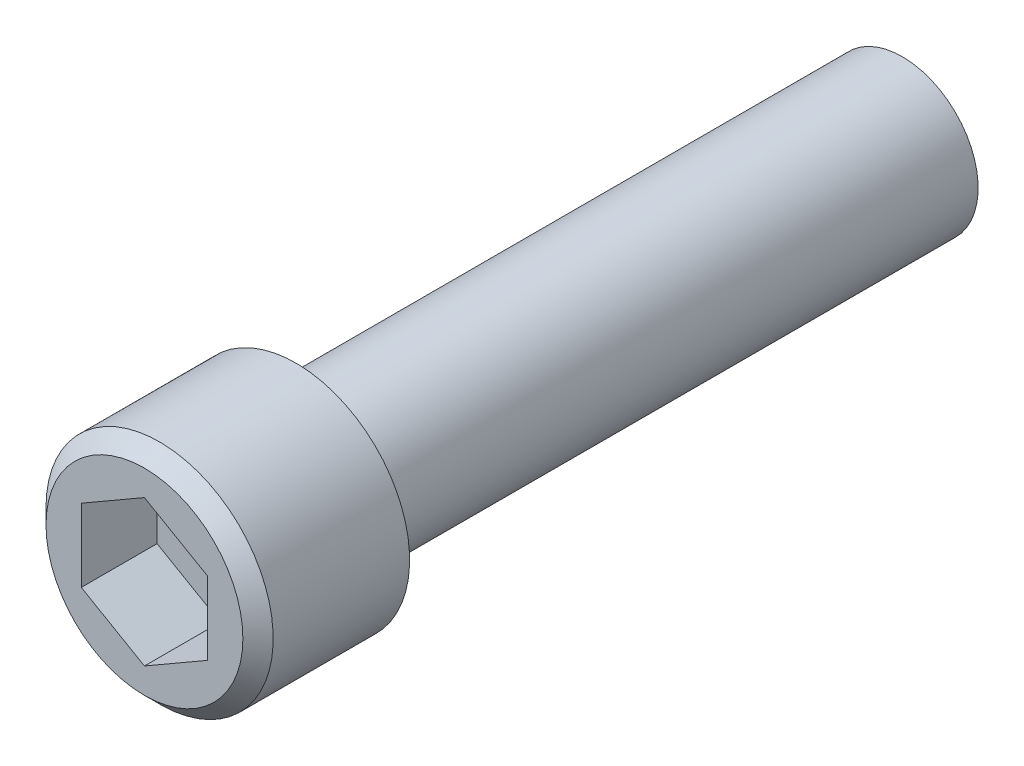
ISO-10303-21;
HEADER;
FILE_DESCRIPTION(('STEP AP214'),'2;1');
FILE_NAME('part.step','',(''),(''),'','','');
FILE_SCHEMA(('AUTOMOTIVE_DESIGN { 1 0 10303 214 1 1 1 1 }'));
ENDSEC;
DATA;
#1=APPLICATION_CONTEXT('core data for automotive mechanical design processes');
#2=APPLICATION_PROTOCOL_DEFINITION('international standard','automotive_design',2000,#1);
#3=PRODUCT_CONTEXT('',#1,'mechanical');
#4=PRODUCT('Part','Part','',(#3));
#5=PRODUCT_RELATED_PRODUCT_CATEGORY('part','',(#4));
#6=PRODUCT_DEFINITION_FORMATION('','',#4);
#7=PRODUCT_DEFINITION_CONTEXT('part definition',#1,'design');
#8=PRODUCT_DEFINITION('design','',#6,#7);
#9=PRODUCT_DEFINITION_SHAPE('','',#8);
#10=(LENGTH_UNIT() NAMED_UNIT(*) SI_UNIT(.MILLI.,.METRE.));
#11=(NAMED_UNIT(*) PLANE_ANGLE_UNIT() SI_UNIT($,.RADIAN.));
#12=(NAMED_UNIT(*) SI_UNIT($,.STERADIAN.) SOLID_ANGLE_UNIT());
#13=UNCERTAINTY_MEASURE_WITH_UNIT(LENGTH_MEASURE(1.E-05),#10,'distance_accuracy_value','');
#14=(GEOMETRIC_REPRESENTATION_CONTEXT(3) GLOBAL_UNCERTAINTY_ASSIGNED_CONTEXT((#13)) GLOBAL_UNIT_ASSIGNED_CONTEXT((#10,
#11,#12)) REPRESENTATION_CONTEXT('',''));
#15=CARTESIAN_POINT('',(0.,0.,0.));
#16=DIRECTION('',(0.,0.,1.));
#17=DIRECTION('',(1.,0.,0.));
#18=AXIS2_PLACEMENT_3D('',#15,#16,#17);
#19=CARTESIAN_POINT('',(-1.11022302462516E-13,-1.11022302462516E-13,38.0999999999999));
#20=DIRECTION('',(0.,0.,-0.999999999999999));
#21=DIRECTION('',(-1.,0.,0.));
#22=AXIS2_PLACEMENT_3D('',#19,#20,#21);
#23=CYLINDRICAL_SURFACE('',#22,4.7625);
#24=CARTESIAN_POINT('',(1.11022302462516E-13,2.22044604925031E-13,37.5920000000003));
#25=DIRECTION('',(0.,0.,1.));
#26=DIRECTION('',(1.,0.,0.));
#27=AXIS2_PLACEMENT_3D('',#24,#25,#26);
#28=CIRCLE('',#27,4.7625);
#29=CARTESIAN_POINT('',(-4.76250000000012,-1.10273484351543E-13,37.5920000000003));
#30=VERTEX_POINT('',#29);
#31=EDGE_CURVE('E151',#30,#30,#28,.F.);
#32=CARTESIAN_POINT('',(0.,0.,0.));
#33=DIRECTION('',(0.,0.,1.));
#34=DIRECTION('',(1.,0.,0.));
#35=AXIS2_PLACEMENT_3D('',#32,#33,#34);
#36=CIRCLE('',#35,4.7625);
#37=CARTESIAN_POINT('',(-4.76250000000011,-1.13551496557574E-13,0.));
#38=VERTEX_POINT('',#37);
#39=EDGE_CURVE('E145',#38,#38,#36,.T.);
#40=CARTESIAN_POINT('',(-4.76250000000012,-1.10273484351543E-13,37.5920000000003));
#41=CARTESIAN_POINT('',(-4.76250000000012,-1.10307630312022E-13,37.200416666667));
#42=CARTESIAN_POINT('',(-4.76250000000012,-1.10341776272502E-13,36.8088333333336));
#43=CARTESIAN_POINT('',(-4.76250000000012,-1.10410068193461E-13,36.0256666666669));
#44=CARTESIAN_POINT('',(-4.76250000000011,-1.1044421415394E-13,35.6340833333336));
#45=CARTESIAN_POINT('',(-4.76250000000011,-1.10512506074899E-13,34.8509166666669));
#46=CARTESIAN_POINT('',(-4.76250000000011,-1.10546652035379E-13,34.4593333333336));
#47=CARTESIAN_POINT('',(-4.76250000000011,-1.10614943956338E-13,33.6761666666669));
#48=CARTESIAN_POINT('',(-4.76250000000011,-1.10649089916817E-13,33.2845833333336));
#49=CARTESIAN_POINT('',(-4.76250000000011,-1.10717381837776E-13,32.5014166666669));
#50=CARTESIAN_POINT('',(-4.76250000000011,-1.10751527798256E-13,32.1098333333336));
#51=CARTESIAN_POINT('',(-4.76250000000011,-1.10819819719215E-13,31.3266666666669));
#52=CARTESIAN_POINT('',(-4.76250000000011,-1.10853965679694E-13,30.9350833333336));
#53=CARTESIAN_POINT('',(-4.76250000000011,-1.10922257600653E-13,30.1519166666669));
#54=CARTESIAN_POINT('',(-4.76250000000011,-1.10956403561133E-13,29.7603333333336));
#55=CARTESIAN_POINT('',(-4.76250000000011,-1.11024695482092E-13,28.9771666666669));
#56=CARTESIAN_POINT('',(-4.76250000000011,-1.11058841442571E-13,28.5855833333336));
#57=CARTESIAN_POINT('',(-4.76250000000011,-1.1112713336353E-13,27.8024166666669));
#58=CARTESIAN_POINT('',(-4.76250000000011,-1.1116127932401E-13,27.4108333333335));
#59=CARTESIAN_POINT('',(-4.76250000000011,-1.11229571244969E-13,26.6276666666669));
#60=CARTESIAN_POINT('',(-4.76250000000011,-1.11263717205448E-13,26.2360833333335));
#61=CARTESIAN_POINT('',(-4.76250000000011,-1.11332009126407E-13,25.4529166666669));
#62=CARTESIAN_POINT('',(-4.76250000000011,-1.11366155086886E-13,25.0613333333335));
#63=CARTESIAN_POINT('',(-4.76250000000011,-1.11434447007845E-13,24.2781666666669));
#64=CARTESIAN_POINT('',(-4.76250000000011,-1.11468592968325E-13,23.8865833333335));
#65=CARTESIAN_POINT('',(-4.76250000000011,-1.11536884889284E-13,23.1034166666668));
#66=CARTESIAN_POINT('',(-4.76250000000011,-1.11571030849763E-13,22.7118333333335));
#67=CARTESIAN_POINT('',(-4.76250000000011,-1.11639322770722E-13,21.9286666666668));
#68=CARTESIAN_POINT('',(-4.76250000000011,-1.11673468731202E-13,21.5370833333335));
#69=CARTESIAN_POINT('',(-4.76250000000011,-1.11741760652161E-13,20.7539166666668));
#70=CARTESIAN_POINT('',(-4.76250000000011,-1.1177590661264E-13,20.3623333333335));
#71=CARTESIAN_POINT('',(-4.76250000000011,-1.11844198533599E-13,19.5791666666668));
#72=CARTESIAN_POINT('',(-4.76250000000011,-1.11878344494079E-13,19.1875833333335));
#73=CARTESIAN_POINT('',(-4.76250000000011,-1.11946636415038E-13,18.4044166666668));
#74=CARTESIAN_POINT('',(-4.76250000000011,-1.11980782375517E-13,18.0128333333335));
#75=CARTESIAN_POINT('',(-4.76250000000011,-1.12049074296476E-13,17.2296666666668));
#76=CARTESIAN_POINT('',(-4.76250000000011,-1.12083220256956E-13,16.8380833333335));
#77=CARTESIAN_POINT('',(-4.76250000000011,-1.12151512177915E-13,16.0549166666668));
#78=CARTESIAN_POINT('',(-4.76250000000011,-1.12185658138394E-13,15.6633333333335));
#79=CARTESIAN_POINT('',(-4.76250000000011,-1.12253950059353E-13,14.8801666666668));
#80=CARTESIAN_POINT('',(-4.76250000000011,-1.12288096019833E-13,14.4885833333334));
#81=CARTESIAN_POINT('',(-4.76250000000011,-1.12356387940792E-13,13.7054166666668));
#82=CARTESIAN_POINT('',(-4.76250000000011,-1.12390533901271E-13,13.3138333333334));
#83=CARTESIAN_POINT('',(-4.76250000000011,-1.1245882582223E-13,12.5306666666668));
#84=CARTESIAN_POINT('',(-4.76250000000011,-1.1249297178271E-13,12.1390833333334));
#85=CARTESIAN_POINT('',(-4.76250000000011,-1.12561263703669E-13,11.3559166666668));
#86=CARTESIAN_POINT('',(-4.76250000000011,-1.12595409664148E-13,10.9643333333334));
#87=CARTESIAN_POINT('',(-4.76250000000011,-1.12663701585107E-13,10.1811666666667));
#88=CARTESIAN_POINT('',(-4.76250000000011,-1.12697847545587E-13,9.78958333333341));
#89=CARTESIAN_POINT('',(-4.76250000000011,-1.12766139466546E-13,9.00641666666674));
#90=CARTESIAN_POINT('',(-4.76250000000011,-1.12800285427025E-13,8.6148333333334));
#91=CARTESIAN_POINT('',(-4.76250000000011,-1.12868577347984E-13,7.83166666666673));
#92=CARTESIAN_POINT('',(-4.76250000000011,-1.12902723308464E-13,7.44008333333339));
#93=CARTESIAN_POINT('',(-4.76250000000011,-1.12971015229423E-13,6.65691666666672));
#94=CARTESIAN_POINT('',(-4.76250000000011,-1.13005161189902E-13,6.26533333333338));
#95=CARTESIAN_POINT('',(-4.76250000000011,-1.13073453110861E-13,5.4821666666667));
#96=CARTESIAN_POINT('',(-4.76250000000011,-1.13107599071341E-13,5.09058333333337));
#97=CARTESIAN_POINT('',(-4.76250000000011,-1.131758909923E-13,4.30741666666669));
#98=CARTESIAN_POINT('',(-4.76250000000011,-1.13210036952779E-13,3.91583333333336));
#99=CARTESIAN_POINT('',(-4.76250000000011,-1.13278328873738E-13,3.13266666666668));
#100=CARTESIAN_POINT('',(-4.76250000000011,-1.13312474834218E-13,2.74108333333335));
#101=CARTESIAN_POINT('',(-4.76250000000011,-1.13380766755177E-13,1.95791666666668));
#102=CARTESIAN_POINT('',(-4.76250000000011,-1.13414912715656E-13,1.56633333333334));
#103=CARTESIAN_POINT('',(-4.76250000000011,-1.13483204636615E-13,0.783166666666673));
#104=CARTESIAN_POINT('',(-4.76250000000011,-1.13517350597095E-13,0.391583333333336));
#105=CARTESIAN_POINT('',(-4.76250000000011,-1.13551496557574E-13,0.));
#106=B_SPLINE_CURVE_WITH_KNOTS('',3,(#40,#41,#42,#43,#44,#45,#46,#47,#48,#49,#50,#51,#52,#53,
#54,#55,#56,#57,#58,#59,#60,#61,#62,#63,#64,#65,#66,#67,#68,#69,#70,#71,#72,#73,#74,#75,#76,#77,
#78,#79,#80,#81,#82,#83,#84,#85,#86,#87,#88,#89,#90,#91,#92,#93,#94,#95,#96,#97,#98,#99,#100,
#101,#102,#103,#104,#105),.UNSPECIFIED.,.F.,.F.,(4,2,2,2,2,2,2,2,2,2,2,2,2,2,2,2,2,2,2,2,2,2,2,
2,2,2,2,2,2,2,2,2,4),(0.,1.17475000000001,2.34950000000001,3.52425000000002,4.69900000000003,
5.87375000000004,7.04850000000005,8.22325000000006,9.39800000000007,10.5727500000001,
11.7475000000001,12.9222500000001,14.0970000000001,15.2717500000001,16.4465000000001,
17.6212500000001,18.7960000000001,19.9707500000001,21.1455000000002,22.3202500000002,
23.4950000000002,24.6697500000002,25.8445000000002,27.0192500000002,28.1940000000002,
29.3687500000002,30.5435000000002,31.7182500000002,32.8930000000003,34.0677500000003,
35.2425000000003,36.4172500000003,37.5920000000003),.UNSPECIFIED.);
#107=EDGE_CURVE('BSEAM38',#30,#38,#106,.T.);
#108=ORIENTED_EDGE('',*,*,#31,.T.);
#109=ORIENTED_EDGE('',*,*,#39,.T.);
#110=ORIENTED_EDGE('',*,*,#107,.T.);
#111=ORIENTED_EDGE('',*,*,#107,.F.);
#112=EDGE_LOOP('',(#108,#110,#109,#111));
#113=FACE_BOUND('',#112,.T.);
#114=ADVANCED_FACE('F38',(#113),#23,.T.);
#115=CARTESIAN_POINT('',(0.,0.,0.));
#116=DIRECTION('',(0.,0.,1.));
#117=DIRECTION('',(1.,0.,0.));
#118=AXIS2_PLACEMENT_3D('',#115,#116,#117);
#119=PLANE('',#118);
#120=ORIENTED_EDGE('',*,*,#39,.F.);
#121=EDGE_LOOP('',(#120));
#122=FACE_BOUND('',#121,.T.);
#123=ADVANCED_FACE('F169',(#122),#119,.F.);
#124=CARTESIAN_POINT('',(-1.11022302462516E-13,-1.11022302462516E-13,38.0999999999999));
#125=DIRECTION('',(0.,0.,1.));
#126=DIRECTION('',(1.,0.,0.));
#127=AXIS2_PLACEMENT_3D('',#124,#125,#126);
#128=PLANE('',#127);
#129=CARTESIAN_POINT('',(-1.11022302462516E-13,-1.11022302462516E-13,38.0999999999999));
#130=DIRECTION('',(0.,0.,1.));
#131=DIRECTION('',(1.,0.,0.));
#132=AXIS2_PLACEMENT_3D('',#129,#130,#131);
#133=CIRCLE('',#132,5.2705);
#134=CARTESIAN_POINT('',(5.27049999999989,-1.11900017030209E-13,38.0999999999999));
#135=VERTEX_POINT('',#134);
#136=EDGE_CURVE('E148',#135,#135,#133,.T.);
#137=ORIENTED_EDGE('',*,*,#136,.T.);
#138=EDGE_LOOP('',(#137));
#139=FACE_BOUND('',#138,.T.);
#140=CARTESIAN_POINT('',(-1.11022302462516E-13,-1.11022302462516E-13,38.0999999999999));
#141=DIRECTION('',(0.,0.,1.));
#142=DIRECTION('',(1.,0.,0.));
#143=AXIS2_PLACEMENT_3D('',#140,#141,#142);
#144=CIRCLE('',#143,7.1374);
#145=CARTESIAN_POINT('',(-7.13740000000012,-1.1066426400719E-13,38.0999999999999));
#146=VERTEX_POINT('',#145);
#147=EDGE_CURVE('E136',#146,#146,#144,.T.);
#148=ORIENTED_EDGE('',*,*,#147,.F.);
#149=EDGE_LOOP('',(#148));
#150=FACE_BOUND('',#149,.T.);
#151=ADVANCED_FACE('F174',(#139,#150),#128,.F.);
#152=CARTESIAN_POINT('',(-1.11022302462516E-13,-1.11022302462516E-13,47.6249999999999));
#153=DIRECTION('',(0.,0.,-0.999999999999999));
#154=DIRECTION('',(-1.,0.,0.));
#155=AXIS2_PLACEMENT_3D('',#152,#153,#154);
#156=CYLINDRICAL_SURFACE('',#155,7.1374);
#157=CARTESIAN_POINT('',(-1.11022302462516E-13,-2.22044604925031E-13,46.6733466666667));
#158=DIRECTION('',(0.,0.,1.));
#159=DIRECTION('',(1.,0.,0.));
#160=AXIS2_PLACEMENT_3D('',#157,#158,#159);
#161=CIRCLE('',#160,7.1374);
#162=CARTESIAN_POINT('',(-7.13740000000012,-1.09916670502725E-13,46.6733466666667));
#163=VERTEX_POINT('',#162);
#164=EDGE_CURVE('E11',#163,#163,#161,.F.);
#165=CARTESIAN_POINT('',(-7.13740000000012,-1.09916670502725E-13,46.6733466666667));
#166=CARTESIAN_POINT('',(-7.13740000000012,-1.09924457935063E-13,46.5840409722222));
#167=CARTESIAN_POINT('',(-7.13740000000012,-1.09932245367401E-13,46.4947352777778));
#168=CARTESIAN_POINT('',(-7.13740000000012,-1.09947820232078E-13,46.3161238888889));
#169=CARTESIAN_POINT('',(-7.13740000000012,-1.09955607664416E-13,46.2268181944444));
#170=CARTESIAN_POINT('',(-7.13740000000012,-1.09971182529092E-13,46.0482068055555));
#171=CARTESIAN_POINT('',(-7.13740000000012,-1.0997896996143E-13,45.9589011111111));
#172=CARTESIAN_POINT('',(-7.13740000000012,-1.09994544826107E-13,45.7802897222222));
#173=CARTESIAN_POINT('',(-7.13740000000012,-1.10002332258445E-13,45.6909840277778));
#174=CARTESIAN_POINT('',(-7.13740000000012,-1.10017907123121E-13,45.5123726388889));
#175=CARTESIAN_POINT('',(-7.13740000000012,-1.10025694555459E-13,45.4230669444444));
#176=CARTESIAN_POINT('',(-7.13740000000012,-1.10041269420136E-13,45.2444555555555));
#177=CARTESIAN_POINT('',(-7.13740000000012,-1.10049056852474E-13,45.1551498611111));
#178=CARTESIAN_POINT('',(-7.13740000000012,-1.1006463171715E-13,44.9765384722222));
#179=CARTESIAN_POINT('',(-7.13740000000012,-1.10072419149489E-13,44.8872327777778));
#180=CARTESIAN_POINT('',(-7.13740000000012,-1.10087994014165E-13,44.7086213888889));
#181=CARTESIAN_POINT('',(-7.13740000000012,-1.10095781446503E-13,44.6193156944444));
#182=CARTESIAN_POINT('',(-7.13740000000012,-1.10111356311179E-13,44.4407043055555));
#183=CARTESIAN_POINT('',(-7.13740000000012,-1.10119143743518E-13,44.3513986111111));
#184=CARTESIAN_POINT('',(-7.13740000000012,-1.10134718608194E-13,44.1727872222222));
#185=CARTESIAN_POINT('',(-7.13740000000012,-1.10142506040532E-13,44.0834815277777));
#186=CARTESIAN_POINT('',(-7.13740000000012,-1.10158080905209E-13,43.9048701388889));
#187=CARTESIAN_POINT('',(-7.13740000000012,-1.10165868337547E-13,43.8155644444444));
#188=CARTESIAN_POINT('',(-7.13740000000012,-1.10181443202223E-13,43.6369530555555));
#189=CARTESIAN_POINT('',(-7.13740000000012,-1.10189230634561E-13,43.5476473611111));
#190=CARTESIAN_POINT('',(-7.13740000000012,-1.10204805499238E-13,43.3690359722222));
#191=CARTESIAN_POINT('',(-7.13740000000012,-1.10212592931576E-13,43.2797302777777));
#192=CARTESIAN_POINT('',(-7.13740000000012,-1.10228167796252E-13,43.1011188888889));
#193=CARTESIAN_POINT('',(-7.13740000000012,-1.1023595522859E-13,43.0118131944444));
#194=CARTESIAN_POINT('',(-7.13740000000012,-1.10251530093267E-13,42.8332018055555));
#195=CARTESIAN_POINT('',(-7.13740000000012,-1.10259317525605E-13,42.7438961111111));
#196=CARTESIAN_POINT('',(-7.13740000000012,-1.10274892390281E-13,42.5652847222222));
#197=CARTESIAN_POINT('',(-7.13740000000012,-1.10282679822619E-13,42.4759790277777));
#198=CARTESIAN_POINT('',(-7.13740000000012,-1.10298254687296E-13,42.2973676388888));
#199=CARTESIAN_POINT('',(-7.13740000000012,-1.10306042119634E-13,42.2080619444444));
#200=CARTESIAN_POINT('',(-7.13740000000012,-1.1032161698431E-13,42.0294505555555));
#201=CARTESIAN_POINT('',(-7.13740000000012,-1.10329404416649E-13,41.9401448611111));
#202=CARTESIAN_POINT('',(-7.13740000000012,-1.10344979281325E-13,41.7615334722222));
#203=CARTESIAN_POINT('',(-7.13740000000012,-1.10352766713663E-13,41.6722277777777));
#204=CARTESIAN_POINT('',(-7.13740000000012,-1.10368341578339E-13,41.4936163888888));
#205=CARTESIAN_POINT('',(-7.13740000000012,-1.10376129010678E-13,41.4043106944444));
#206=CARTESIAN_POINT('',(-7.13740000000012,-1.10391703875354E-13,41.2256993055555));
#207=CARTESIAN_POINT('',(-7.13740000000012,-1.10399491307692E-13,41.1363936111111));
#208=CARTESIAN_POINT('',(-7.13740000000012,-1.10415066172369E-13,40.9577822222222));
#209=CARTESIAN_POINT('',(-7.13740000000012,-1.10422853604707E-13,40.8684765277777));
#210=CARTESIAN_POINT('',(-7.13740000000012,-1.10438428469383E-13,40.6898651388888));
#211=CARTESIAN_POINT('',(-7.13740000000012,-1.10446215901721E-13,40.6005594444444));
#212=CARTESIAN_POINT('',(-7.13740000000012,-1.10461790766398E-13,40.4219480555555));
#213=CARTESIAN_POINT('',(-7.13740000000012,-1.10469578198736E-13,40.332642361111));
#214=CARTESIAN_POINT('',(-7.13740000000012,-1.10485153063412E-13,40.1540309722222));
#215=CARTESIAN_POINT('',(-7.13740000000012,-1.1049294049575E-13,40.0647252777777));
#216=CARTESIAN_POINT('',(-7.13740000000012,-1.10508515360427E-13,39.8861138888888));
#217=CARTESIAN_POINT('',(-7.13740000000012,-1.10516302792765E-13,39.7968081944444));
#218=CARTESIAN_POINT('',(-7.13740000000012,-1.10531877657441E-13,39.6181968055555));
#219=CARTESIAN_POINT('',(-7.13740000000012,-1.1053966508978E-13,39.528891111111));
#220=CARTESIAN_POINT('',(-7.13740000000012,-1.10555239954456E-13,39.3502797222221));
#221=CARTESIAN_POINT('',(-7.13740000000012,-1.10563027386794E-13,39.2609740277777));
#222=CARTESIAN_POINT('',(-7.13740000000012,-1.1057860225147E-13,39.0823626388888));
#223=CARTESIAN_POINT('',(-7.13740000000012,-1.10586389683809E-13,38.9930569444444));
#224=CARTESIAN_POINT('',(-7.13740000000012,-1.10601964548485E-13,38.8144455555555));
#225=CARTESIAN_POINT('',(-7.13740000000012,-1.10609751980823E-13,38.725139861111));
#226=CARTESIAN_POINT('',(-7.13740000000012,-1.106253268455E-13,38.5465284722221));
#227=CARTESIAN_POINT('',(-7.13740000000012,-1.10633114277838E-13,38.4572227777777));
#228=CARTESIAN_POINT('',(-7.13740000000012,-1.10648689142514E-13,38.2786113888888));
#229=CARTESIAN_POINT('',(-7.13740000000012,-1.10656476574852E-13,38.1893056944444));
#230=CARTESIAN_POINT('',(-7.13740000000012,-1.1066426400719E-13,38.0999999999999));
#231=B_SPLINE_CURVE_WITH_KNOTS('',3,(#165,#166,#167,#168,#169,#170,#171,#172,#173,#174,#175,
#176,#177,#178,#179,#180,#181,#182,#183,#184,#185,#186,#187,#188,#189,#190,#191,#192,#193,#194,
#195,#196,#197,#198,#199,#200,#201,#202,#203,#204,#205,#206,#207,#208,#209,#210,#211,#212,#213,
#214,#215,#216,#217,#218,#219,#220,#221,#222,#223,#224,#225,#226,#227,#228,#229,#230),
.UNSPECIFIED.,.F.,.F.,(4,2,2,2,2,2,2,2,2,2,2,2,2,2,2,2,2,2,2,2,2,2,2,2,2,2,2,2,2,2,2,2,4),(0.,
0.26791708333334,0.535834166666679,0.803751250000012,1.07166833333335,1.33958541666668,
1.60750250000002,1.87541958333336,2.1433366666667,2.41125375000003,2.67917083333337,
2.9470879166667,3.21500500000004,3.48292208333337,3.75083916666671,4.01875625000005,
4.28667333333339,4.55459041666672,4.82250750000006,5.09042458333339,5.35834166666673,
5.62625875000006,5.8941758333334,6.16209291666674,6.43001000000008,6.69792708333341,
6.96584416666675,7.23376125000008,7.50167833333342,7.76959541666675,8.03751250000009,
8.30542958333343,8.57334666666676),.UNSPECIFIED.);
#232=EDGE_CURVE('BSEAM189',#163,#146,#231,.T.);
#233=ORIENTED_EDGE('',*,*,#164,.T.);
#234=ORIENTED_EDGE('',*,*,#147,.T.);
#235=ORIENTED_EDGE('',*,*,#232,.T.);
#236=ORIENTED_EDGE('',*,*,#232,.F.);
#237=EDGE_LOOP('',(#233,#235,#234,#236));
#238=FACE_BOUND('',#237,.T.);
#239=ADVANCED_FACE('F189',(#238),#156,.T.);
#240=CARTESIAN_POINT('',(-1.11022302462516E-13,-1.11022302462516E-13,47.6249999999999));
#241=DIRECTION('',(0.,0.,1.));
#242=DIRECTION('',(1.,0.,0.));
#243=AXIS2_PLACEMENT_3D('',#240,#241,#242);
#244=PLANE('',#243);
#245=CARTESIAN_POINT('',(-1.11022302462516E-13,-1.11022302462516E-13,47.6249999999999));
#246=DIRECTION('',(0.,0.,1.));
#247=DIRECTION('',(1.,0.,0.));
#248=AXIS2_PLACEMENT_3D('',#245,#246,#247);
#249=CIRCLE('',#248,6.18574666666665);
#250=CARTESIAN_POINT('',(6.18574666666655,-1.1205243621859E-13,47.6249999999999));
#251=VERTEX_POINT('',#250);
#252=EDGE_CURVE('E45',#251,#251,#249,.T.);
#253=ORIENTED_EDGE('',*,*,#252,.T.);
#254=EDGE_LOOP('',(#253));
#255=FACE_BOUND('',#254,.T.);
#256=DIRECTION('',(-0.866025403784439,-0.5,0.));
#257=VECTOR('',#256,1.);
#258=CARTESIAN_POINT('',(1.11022302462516E-13,4.5827177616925,47.6250000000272));
#259=LINE('',#258,#257);
#260=CARTESIAN_POINT('',(1.11022302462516E-13,4.5827177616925,47.6250000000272));
#261=VERTEX_POINT('',#260);
#262=CARTESIAN_POINT('',(-3.96875000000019,2.29135888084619,47.625));
#263=VERTEX_POINT('',#262);
#264=EDGE_CURVE('E52',#261,#263,#259,.T.);
#265=ORIENTED_EDGE('',*,*,#264,.F.);
#266=DIRECTION('',(0.86602540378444,-0.500000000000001,0.));
#267=VECTOR('',#266,1.);
#268=CARTESIAN_POINT('',(1.11022302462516E-13,4.5827177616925,47.6250000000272));
#269=LINE('',#268,#267);
#270=CARTESIAN_POINT('',(3.96874999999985,2.29135888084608,47.6250000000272));
#271=VERTEX_POINT('',#270);
#272=EDGE_CURVE('E119',#261,#271,#269,.T.);
#273=ORIENTED_EDGE('',*,*,#272,.T.);
#274=DIRECTION('',(0.,-1.,0.));
#275=VECTOR('',#274,1.);
#276=CARTESIAN_POINT('',(3.96874999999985,2.29135888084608,47.6250000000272));
#277=LINE('',#276,#275);
#278=CARTESIAN_POINT('',(3.96874999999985,-2.29135888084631,47.6250000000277));
#279=VERTEX_POINT('',#278);
#280=EDGE_CURVE('E114',#271,#279,#277,.T.);
#281=ORIENTED_EDGE('',*,*,#280,.T.);
#282=DIRECTION('',(0.86602540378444,0.5,0.));
#283=VECTOR('',#282,1.);
#284=CARTESIAN_POINT('',(-1.11022302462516E-13,-4.58271776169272,47.6250000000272));
#285=LINE('',#284,#283);
#286=CARTESIAN_POINT('',(-1.11022302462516E-13,-4.58271776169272,47.6250000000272));
#287=VERTEX_POINT('',#286);
#288=EDGE_CURVE('E112',#287,#279,#285,.T.);
#289=ORIENTED_EDGE('',*,*,#288,.F.);
#290=DIRECTION('',(-0.866025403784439,0.500000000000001,0.));
#291=VECTOR('',#290,1.);
#292=CARTESIAN_POINT('',(-1.11022302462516E-13,-4.58271776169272,47.6250000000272));
#293=LINE('',#292,#291);
#294=CARTESIAN_POINT('',(-3.96875000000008,-2.29135888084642,47.6250000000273));
#295=VERTEX_POINT('',#294);
#296=EDGE_CURVE('E94',#287,#295,#293,.T.);
#297=ORIENTED_EDGE('',*,*,#296,.T.);
#298=DIRECTION('',(0.,-1.,0.));
#299=VECTOR('',#298,1.);
#300=CARTESIAN_POINT('',(-3.96875000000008,2.29135888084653,47.6250000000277));
#301=LINE('',#300,#299);
#302=EDGE_CURVE('E105',#263,#295,#301,.T.);
#303=ORIENTED_EDGE('',*,*,#302,.F.);
#304=EDGE_LOOP('',(#265,#273,#281,#289,#297,#303));
#305=FACE_BOUND('',#304,.T.);
#306=ADVANCED_FACE('F109',(#255,#305),#244,.T.);
#307=CARTESIAN_POINT('',(1.11022302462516E-13,2.22044604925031E-13,37.5920000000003));
#308=DIRECTION('',(0.,0.,1.));
#309=DIRECTION('',(1.,0.,0.));
#310=AXIS2_PLACEMENT_3D('',#307,#308,#309);
#311=TOROIDAL_SURFACE('',#310,5.2705,0.508);
#312=ORIENTED_EDGE('',*,*,#31,.F.);
#313=EDGE_LOOP('',(#312));
#314=FACE_BOUND('',#313,.T.);
#315=ORIENTED_EDGE('',*,*,#136,.F.);
#316=EDGE_LOOP('',(#315));
#317=FACE_BOUND('',#316,.T.);
#318=ADVANCED_FACE('F180',(#314,#317),#311,.F.);
#319=CARTESIAN_POINT('',(-1.11022302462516E-13,4.58271776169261,42.8625000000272));
#320=DIRECTION('',(-0.5,0.86602540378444,0.));
#321=DIRECTION('',(-0.866025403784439,-0.5,0.));
#322=AXIS2_PLACEMENT_3D('',#319,#320,#321);
#323=PLANE('',#322);
#324=ORIENTED_EDGE('',*,*,#264,.T.);
#325=DIRECTION('',(0.,0.,0.999999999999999));
#326=VECTOR('',#325,1.);
#327=CARTESIAN_POINT('',(-3.96875000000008,2.29135888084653,42.8625000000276));
#328=LINE('',#327,#326);
#329=CARTESIAN_POINT('',(-3.96875000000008,2.29135888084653,42.8625000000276));
#330=VERTEX_POINT('',#329);
#331=EDGE_CURVE('E102',#330,#263,#328,.T.);
#332=ORIENTED_EDGE('',*,*,#331,.F.);
#333=DIRECTION('',(-0.866025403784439,-0.5,0.));
#334=VECTOR('',#333,1.);
#335=CARTESIAN_POINT('',(-1.11022302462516E-13,4.58271776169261,42.8625000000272));
#336=LINE('',#335,#334);
#337=CARTESIAN_POINT('',(-1.11022302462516E-13,4.58271776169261,42.8625000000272));
#338=VERTEX_POINT('',#337);
#339=EDGE_CURVE('E122',#338,#330,#336,.T.);
#340=ORIENTED_EDGE('',*,*,#339,.F.);
#341=DIRECTION('',(0.,0.,0.999999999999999));
#342=VECTOR('',#341,1.);
#343=CARTESIAN_POINT('',(-1.11022302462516E-13,4.58271776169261,42.8625000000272));
#344=LINE('',#343,#342);
#345=EDGE_CURVE('E59',#338,#261,#344,.T.);
#346=ORIENTED_EDGE('',*,*,#345,.T.);
#347=EDGE_LOOP('',(#324,#332,#340,#346));
#348=FACE_BOUND('',#347,.T.);
#349=ADVANCED_FACE('F183',(#348),#323,.F.);
#350=CARTESIAN_POINT('',(-1.11022302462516E-13,4.58271776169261,42.8625000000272));
#351=DIRECTION('',(-0.5,-0.86602540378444,0.));
#352=DIRECTION('',(0.86602540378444,-0.500000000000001,0.));
#353=AXIS2_PLACEMENT_3D('',#350,#351,#352);
#354=PLANE('',#353);
#355=ORIENTED_EDGE('',*,*,#272,.F.);
#356=ORIENTED_EDGE('',*,*,#345,.F.);
#357=DIRECTION('',(0.86602540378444,-0.500000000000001,0.));
#358=VECTOR('',#357,1.);
#359=CARTESIAN_POINT('',(-1.11022302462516E-13,4.58271776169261,42.8625000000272));
#360=LINE('',#359,#358);
#361=CARTESIAN_POINT('',(3.96875000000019,2.29135888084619,42.8625000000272));
#362=VERTEX_POINT('',#361);
#363=EDGE_CURVE('E133',#338,#362,#360,.T.);
#364=ORIENTED_EDGE('',*,*,#363,.T.);
#365=DIRECTION('',(0.,0.,0.999999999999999));
#366=VECTOR('',#365,1.);
#367=CARTESIAN_POINT('',(3.96875000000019,2.29135888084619,42.8625000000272));
#368=LINE('',#367,#366);
#369=EDGE_CURVE('E137',#362,#271,#368,.T.);
#370=ORIENTED_EDGE('',*,*,#369,.T.);
#371=EDGE_LOOP('',(#355,#356,#364,#370));
#372=FACE_BOUND('',#371,.T.);
#373=ADVANCED_FACE('F203',(#372),#354,.T.);
#374=CARTESIAN_POINT('',(3.96875000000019,2.29135888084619,42.8625000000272));
#375=DIRECTION('',(-1.,0.,0.));
#376=DIRECTION('',(0.,0.,1.));
#377=AXIS2_PLACEMENT_3D('',#374,#375,#376);
#378=PLANE('',#377);
#379=ORIENTED_EDGE('',*,*,#280,.F.);
#380=ORIENTED_EDGE('',*,*,#369,.F.);
#381=DIRECTION('',(0.,-1.,0.));
#382=VECTOR('',#381,1.);
#383=CARTESIAN_POINT('',(3.96875000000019,2.29135888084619,42.8625000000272));
#384=LINE('',#383,#382);
#385=CARTESIAN_POINT('',(3.96875000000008,-2.29135888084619,42.8625000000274));
#386=VERTEX_POINT('',#385);
#387=EDGE_CURVE('E131',#362,#386,#384,.T.);
#388=ORIENTED_EDGE('',*,*,#387,.T.);
#389=DIRECTION('',(0.,0.,0.999999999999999));
#390=VECTOR('',#389,1.);
#391=CARTESIAN_POINT('',(3.96875000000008,-2.29135888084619,42.8625000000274));
#392=LINE('',#391,#390);
#393=EDGE_CURVE('E139',#386,#279,#392,.T.);
#394=ORIENTED_EDGE('',*,*,#393,.T.);
#395=EDGE_LOOP('',(#379,#380,#388,#394));
#396=FACE_BOUND('',#395,.T.);
#397=ADVANCED_FACE('F211',(#396),#378,.T.);
#398=CARTESIAN_POINT('',(-1.11022302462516E-13,-4.58271776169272,42.8625000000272));
#399=DIRECTION('',(0.500000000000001,-0.86602540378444,0.));
#400=DIRECTION('',(0.866025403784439,0.5,0.));
#401=AXIS2_PLACEMENT_3D('',#398,#399,#400);
#402=PLANE('',#401);
#403=ORIENTED_EDGE('',*,*,#288,.T.);
#404=ORIENTED_EDGE('',*,*,#393,.F.);
#405=DIRECTION('',(0.86602540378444,0.5,0.));
#406=VECTOR('',#405,1.);
#407=CARTESIAN_POINT('',(-1.11022302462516E-13,-4.58271776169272,42.8625000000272));
#408=LINE('',#407,#406);
#409=CARTESIAN_POINT('',(-1.11022302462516E-13,-4.58271776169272,42.8625000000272));
#410=VERTEX_POINT('',#409);
#411=EDGE_CURVE('E128',#410,#386,#408,.T.);
#412=ORIENTED_EDGE('',*,*,#411,.F.);
#413=DIRECTION('',(0.,0.,0.999999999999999));
#414=VECTOR('',#413,1.);
#415=CARTESIAN_POINT('',(-1.11022302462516E-13,-4.58271776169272,42.8625000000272));
#416=LINE('',#415,#414);
#417=EDGE_CURVE('E101',#410,#287,#416,.T.);
#418=ORIENTED_EDGE('',*,*,#417,.T.);
#419=EDGE_LOOP('',(#403,#404,#412,#418));
#420=FACE_BOUND('',#419,.T.);
#421=ADVANCED_FACE('F208',(#420),#402,.F.);
#422=CARTESIAN_POINT('',(-1.11022302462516E-13,-4.58271776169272,42.8625000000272));
#423=DIRECTION('',(0.5,0.86602540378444,0.));
#424=DIRECTION('',(-0.866025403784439,0.500000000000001,0.));
#425=AXIS2_PLACEMENT_3D('',#422,#423,#424);
#426=PLANE('',#425);
#427=ORIENTED_EDGE('',*,*,#296,.F.);
#428=ORIENTED_EDGE('',*,*,#417,.F.);
#429=DIRECTION('',(-0.866025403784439,0.500000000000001,0.));
#430=VECTOR('',#429,1.);
#431=CARTESIAN_POINT('',(-1.11022302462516E-13,-4.58271776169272,42.8625000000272));
#432=LINE('',#431,#430);
#433=CARTESIAN_POINT('',(-3.9687500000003,-2.29135888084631,42.8625000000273));
#434=VERTEX_POINT('',#433);
#435=EDGE_CURVE('E97',#410,#434,#432,.T.);
#436=ORIENTED_EDGE('',*,*,#435,.T.);
#437=DIRECTION('',(0.,0.,0.999999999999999));
#438=VECTOR('',#437,1.);
#439=CARTESIAN_POINT('',(-3.9687500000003,-2.29135888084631,42.8625000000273));
#440=LINE('',#439,#438);
#441=EDGE_CURVE('E90',#434,#295,#440,.T.);
#442=ORIENTED_EDGE('',*,*,#441,.T.);
#443=EDGE_LOOP('',(#427,#428,#436,#442));
#444=FACE_BOUND('',#443,.T.);
#445=ADVANCED_FACE('F92',(#444),#426,.T.);
#446=CARTESIAN_POINT('',(-3.96875000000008,2.29135888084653,42.8625000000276));
#447=DIRECTION('',(-1.,0.,0.));
#448=DIRECTION('',(0.,0.,1.));
#449=AXIS2_PLACEMENT_3D('',#446,#447,#448);
#450=PLANE('',#449);
#451=ORIENTED_EDGE('',*,*,#302,.T.);
#452=ORIENTED_EDGE('',*,*,#441,.F.);
#453=DIRECTION('',(0.,-1.,0.));
#454=VECTOR('',#453,1.);
#455=CARTESIAN_POINT('',(-3.96875000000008,2.29135888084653,42.8625000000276));
#456=LINE('',#455,#454);
#457=EDGE_CURVE('E125',#330,#434,#456,.T.);
#458=ORIENTED_EDGE('',*,*,#457,.F.);
#459=ORIENTED_EDGE('',*,*,#331,.T.);
#460=EDGE_LOOP('',(#451,#452,#458,#459));
#461=FACE_BOUND('',#460,.T.);
#462=ADVANCED_FACE('F106',(#461),#450,.F.);
#463=CARTESIAN_POINT('',(-3.96875000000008,2.29135888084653,42.8625000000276));
#464=DIRECTION('',(0.,0.,1.));
#465=DIRECTION('',(1.,0.,0.));
#466=AXIS2_PLACEMENT_3D('',#463,#464,#465);
#467=PLANE('',#466);
#468=ORIENTED_EDGE('',*,*,#339,.T.);
#469=ORIENTED_EDGE('',*,*,#457,.T.);
#470=ORIENTED_EDGE('',*,*,#435,.F.);
#471=ORIENTED_EDGE('',*,*,#411,.T.);
#472=ORIENTED_EDGE('',*,*,#387,.F.);
#473=ORIENTED_EDGE('',*,*,#363,.F.);
#474=EDGE_LOOP('',(#468,#469,#470,#471,#472,#473));
#475=FACE_BOUND('',#474,.T.);
#476=ADVANCED_FACE('F159',(#475),#467,.T.);
#477=CARTESIAN_POINT('',(-1.11022302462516E-13,-1.11022302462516E-13,47.6249999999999));
#478=DIRECTION('',(0.,0.,-1.));
#479=DIRECTION('',(-1.,0.,0.));
#480=AXIS2_PLACEMENT_3D('',#477,#478,#479);
#481=CONICAL_SURFACE('',#480,6.18574666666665,0.785398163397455);
#482=ORIENTED_EDGE('',*,*,#164,.F.);
#483=EDGE_LOOP('',(#482));
#484=FACE_BOUND('',#483,.T.);
#485=ORIENTED_EDGE('',*,*,#252,.F.);
#486=EDGE_LOOP('',(#485));
#487=FACE_BOUND('',#486,.T.);
#488=ADVANCED_FACE('F157',(#484,#487),#481,.T.);
#489=CLOSED_SHELL('',(#114,#123,#151,#239,#306,#318,#349,#373,#397,#421,#445,#462,#476,#488));
#490=MANIFOLD_SOLID_BREP('B2',#489);
#491=ADVANCED_BREP_SHAPE_REPRESENTATION('',(#18,#490),#14);
#492=SHAPE_DEFINITION_REPRESENTATION(#9,#491);
ENDSEC;
END-ISO-10303-21;
